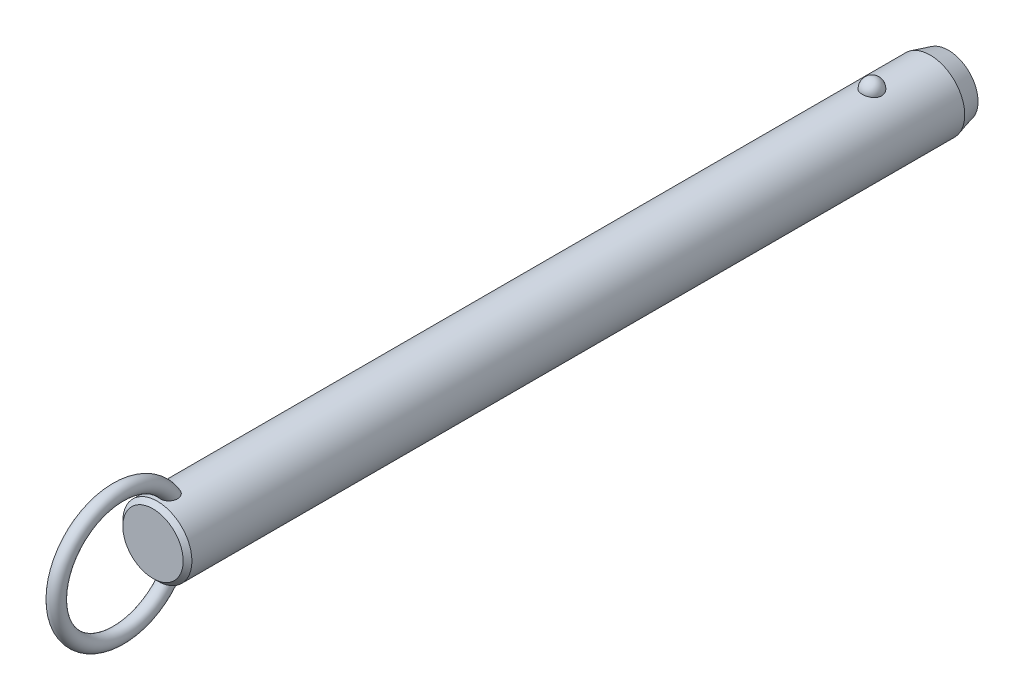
ISO-10303-21;
HEADER;
FILE_DESCRIPTION(('STEP AP214'),'2;1');
FILE_NAME('part.step','',(''),(''),'','','');
FILE_SCHEMA(('AUTOMOTIVE_DESIGN { 1 0 10303 214 1 1 1 1 }'));
ENDSEC;
DATA;
#1=APPLICATION_CONTEXT('core data for automotive mechanical design processes');
#2=APPLICATION_PROTOCOL_DEFINITION('international standard','automotive_design',2000,#1);
#3=PRODUCT_CONTEXT('',#1,'mechanical');
#4=PRODUCT('Part','Part','',(#3));
#5=PRODUCT_RELATED_PRODUCT_CATEGORY('part','',(#4));
#6=PRODUCT_DEFINITION_FORMATION('','',#4);
#7=PRODUCT_DEFINITION_CONTEXT('part definition',#1,'design');
#8=PRODUCT_DEFINITION('design','',#6,#7);
#9=PRODUCT_DEFINITION_SHAPE('','',#8);
#10=(LENGTH_UNIT() NAMED_UNIT(*) SI_UNIT(.MILLI.,.METRE.));
#11=(NAMED_UNIT(*) PLANE_ANGLE_UNIT() SI_UNIT($,.RADIAN.));
#12=(NAMED_UNIT(*) SI_UNIT($,.STERADIAN.) SOLID_ANGLE_UNIT());
#13=UNCERTAINTY_MEASURE_WITH_UNIT(LENGTH_MEASURE(1.E-05),#10,'distance_accuracy_value','');
#14=(GEOMETRIC_REPRESENTATION_CONTEXT(3) GLOBAL_UNCERTAINTY_ASSIGNED_CONTEXT((#13)) GLOBAL_UNIT_ASSIGNED_CONTEXT((#10,
#11,#12)) REPRESENTATION_CONTEXT('',''));
#15=CARTESIAN_POINT('',(0.,0.,0.));
#16=DIRECTION('',(0.,0.,1.));
#17=DIRECTION('',(1.,0.,0.));
#18=AXIS2_PLACEMENT_3D('',#15,#16,#17);
#19=CARTESIAN_POINT('',(0.,0.,185.4));
#20=DIRECTION('',(0.,0.,-1.));
#21=DIRECTION('',(-1.,0.,0.));
#22=AXIS2_PLACEMENT_3D('',#19,#20,#21);
#23=CYLINDRICAL_SURFACE('',#22,9.5);
#24=CARTESIAN_POINT('',(2.67259918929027,9.11631578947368,-2.70000000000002));
#25=CARTESIAN_POINT('',(2.6725968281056,9.11631786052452,-2.54909854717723));
#26=CARTESIAN_POINT('',(2.66030567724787,9.11994722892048,-2.39816735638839));
#27=CARTESIAN_POINT('',(2.6114347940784,9.13405924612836,-2.10058568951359));
#28=CARTESIAN_POINT('',(2.57484658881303,9.14454428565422,-1.95393672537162));
#29=CARTESIAN_POINT('',(2.47830875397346,9.17117631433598,-1.66916069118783));
#30=CARTESIAN_POINT('',(2.41836936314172,9.18732082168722,-1.53102991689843));
#31=CARTESIAN_POINT('',(2.27661331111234,9.22346780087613,-1.26705393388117));
#32=CARTESIAN_POINT('',(2.19479699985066,9.24347021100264,-1.14120852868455));
#33=CARTESIAN_POINT('',(2.01085282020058,9.28522401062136,-0.904632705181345));
#34=CARTESIAN_POINT('',(1.90862396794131,9.30698376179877,-0.79398224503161));
#35=CARTESIAN_POINT('',(1.6867437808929,9.34973971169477,-0.591607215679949));
#36=CARTESIAN_POINT('',(1.56709244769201,9.37073591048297,-0.499882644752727));
#37=CARTESIAN_POINT('',(1.31393976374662,9.40956370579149,-0.338167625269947));
#38=CARTESIAN_POINT('',(1.18048026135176,9.42740444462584,-0.268113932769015));
#39=CARTESIAN_POINT('',(0.903154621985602,9.45799906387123,-0.151390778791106));
#40=CARTESIAN_POINT('',(0.759289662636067,9.47075351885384,-0.104718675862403));
#41=CARTESIAN_POINT('',(0.46807402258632,9.48956256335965,-0.0367633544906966));
#42=CARTESIAN_POINT('',(0.320836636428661,9.49573643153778,-0.0150275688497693));
#43=CARTESIAN_POINT('',(0.0246714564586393,9.50112183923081,0.0039619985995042));
#44=CARTESIAN_POINT('',(-0.124256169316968,9.50033406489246,0.00121819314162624));
#45=CARTESIAN_POINT('',(-0.417264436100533,9.4919475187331,-0.0284441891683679));
#46=CARTESIAN_POINT('',(-0.561384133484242,9.48444885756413,-0.0550074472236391));
#47=CARTESIAN_POINT('',(-0.842986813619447,9.46357853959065,-0.131064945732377));
#48=CARTESIAN_POINT('',(-0.98046968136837,9.450206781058,-0.180559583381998));
#49=CARTESIAN_POINT('',(-1.24585005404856,9.41890822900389,-0.301476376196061));
#50=CARTESIAN_POINT('',(-1.37368611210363,9.40095498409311,-0.373026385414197));
#51=CARTESIAN_POINT('',(-1.61552738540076,9.36242964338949,-0.53602540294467));
#52=CARTESIAN_POINT('',(-1.72953116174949,9.34185727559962,-0.627476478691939));
#53=CARTESIAN_POINT('',(-1.9429225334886,9.29984568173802,-0.829844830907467));
#54=CARTESIAN_POINT('',(-2.04198021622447,9.27839736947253,-0.941108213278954));
#55=CARTESIAN_POINT('',(-2.2202646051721,9.23735994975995,-1.17883414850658));
#56=CARTESIAN_POINT('',(-2.29948985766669,9.21777097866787,-1.30529781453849));
#57=CARTESIAN_POINT('',(-2.43697287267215,9.18238994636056,-1.57158566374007));
#58=CARTESIAN_POINT('',(-2.49497068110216,9.16664569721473,-1.71155057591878));
#59=CARTESIAN_POINT('',(-2.5872073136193,9.14104303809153,-1.99961197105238));
#60=CARTESIAN_POINT('',(-2.62144683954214,9.13118445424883,-2.1477082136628));
#61=CARTESIAN_POINT('',(-2.66521466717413,9.11850622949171,-2.44715424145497));
#62=CARTESIAN_POINT('',(-2.67484831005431,9.11565658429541,-2.59848735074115));
#63=CARTESIAN_POINT('',(-2.66946735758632,9.11723375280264,-2.90067317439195));
#64=CARTESIAN_POINT('',(-2.65445345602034,9.12166036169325,-3.05152590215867));
#65=CARTESIAN_POINT('',(-2.60029711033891,9.13724422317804,-3.34766110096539));
#66=CARTESIAN_POINT('',(-2.56127978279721,9.14836656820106,-3.49296833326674));
#67=CARTESIAN_POINT('',(-2.46018844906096,9.17606676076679,-3.77477535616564));
#68=CARTESIAN_POINT('',(-2.39811349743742,9.19264483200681,-3.91127478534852));
#69=CARTESIAN_POINT('',(-2.25202303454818,9.22952198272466,-4.17244273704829));
#70=CARTESIAN_POINT('',(-2.16788714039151,9.24984129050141,-4.29704106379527));
#71=CARTESIAN_POINT('',(-1.9799408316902,9.29188255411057,-4.53013066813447));
#72=CARTESIAN_POINT('',(-1.87612963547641,9.31360456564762,-4.63862130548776));
#73=CARTESIAN_POINT('',(-1.65105429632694,9.35612959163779,-4.83690299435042));
#74=CARTESIAN_POINT('',(-1.52972405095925,9.37692871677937,-4.9266199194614));
#75=CARTESIAN_POINT('',(-1.27318250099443,9.41518970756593,-5.08429106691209));
#76=CARTESIAN_POINT('',(-1.13797219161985,9.432651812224,-5.15224684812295));
#77=CARTESIAN_POINT('',(-0.859280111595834,9.46208255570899,-5.26371827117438));
#78=CARTESIAN_POINT('',(-0.715925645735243,9.47411833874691,-5.30753421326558));
#79=CARTESIAN_POINT('',(-0.423550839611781,9.4916822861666,-5.37076321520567));
#80=CARTESIAN_POINT('',(-0.274531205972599,9.49721125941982,-5.39017930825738));
#81=CARTESIAN_POINT('',(0.0218446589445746,9.50110860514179,-5.40390587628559));
#82=CARTESIAN_POINT('',(0.169177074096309,9.49961381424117,-5.39869609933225));
#83=CARTESIAN_POINT('',(0.460808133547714,9.48993906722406,-5.36441955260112));
#84=CARTESIAN_POINT('',(0.605106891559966,9.48175936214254,-5.33535367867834));
#85=CARTESIAN_POINT('',(0.886027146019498,9.4596376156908,-5.25435587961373));
#86=CARTESIAN_POINT('',(1.02267710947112,9.44571881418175,-5.20251612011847));
#87=CARTESIAN_POINT('',(1.28523827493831,9.41358993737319,-5.07741549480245));
#88=CARTESIAN_POINT('',(1.41114877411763,9.39537958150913,-5.00415322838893));
#89=CARTESIAN_POINT('',(1.65085227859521,9.3562644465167,-4.83684599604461));
#90=CARTESIAN_POINT('',(1.76442346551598,9.33532178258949,-4.74249218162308));
#91=CARTESIAN_POINT('',(1.97425672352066,9.29321198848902,-4.53620389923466));
#92=CARTESIAN_POINT('',(2.07051582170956,9.27204482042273,-4.42426641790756));
#93=CARTESIAN_POINT('',(2.24490086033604,9.23139221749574,-4.18363183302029));
#94=CARTESIAN_POINT('',(2.32267019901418,9.21194380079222,-4.05466990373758));
#95=CARTESIAN_POINT('',(2.45584092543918,9.1773419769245,-3.78517836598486));
#96=CARTESIAN_POINT('',(2.5112497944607,9.16218713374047,-3.644652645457));
#97=CARTESIAN_POINT('',(2.59380876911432,9.13913522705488,-3.37104301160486));
#98=CARTESIAN_POINT('',(2.62330266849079,9.13064624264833,-3.23871053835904));
#99=CARTESIAN_POINT('',(2.66269870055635,9.11923566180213,-2.97092664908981));
#100=CARTESIAN_POINT('',(2.67260130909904,9.11631393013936,-2.83547530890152));
#101=CARTESIAN_POINT('',(2.67259918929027,9.11631578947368,-2.70000000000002));
#102=B_SPLINE_CURVE_WITH_KNOTS('',3,(#24,#25,#26,#27,#28,#29,#30,#31,#32,#33,#34,#35,#36,#37,
#38,#39,#40,#41,#42,#43,#44,#45,#46,#47,#48,#49,#50,#51,#52,#53,#54,#55,#56,#57,#58,#59,#60,#61,
#62,#63,#64,#65,#66,#67,#68,#69,#70,#71,#72,#73,#74,#75,#76,#77,#78,#79,#80,#81,#82,#83,#84,#85,
#86,#87,#88,#89,#90,#91,#92,#93,#94,#95,#96,#97,#98,#99,#100,#101),.UNSPECIFIED.,.T.,.F.,(4,2,2,
2,2,2,2,2,2,2,2,2,2,2,2,2,2,2,2,2,2,2,2,2,2,2,2,2,2,2,2,2,2,2,2,2,2,2,4),(0.,0.452217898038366,
0.904593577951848,1.35677112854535,1.80894144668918,2.26340676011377,2.71787203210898,
3.17099820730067,3.62407318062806,4.0687883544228,4.51345969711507,4.95160616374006,
5.38976021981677,5.83050358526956,6.27129275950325,6.72071308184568,7.17016633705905,
7.62495278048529,8.07972578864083,8.53254856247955,8.98535859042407,9.43582813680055,
9.88631615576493,10.3393155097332,10.7923328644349,11.2471065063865,11.7018475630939,
12.150795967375,12.599688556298,13.0398725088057,13.4800399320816,13.9184421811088,
14.3568730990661,14.802202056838,15.2476074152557,15.7010097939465,16.1542603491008,
16.5602594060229,16.9662486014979),.UNSPECIFIED.);
#103=CARTESIAN_POINT('',(2.67259918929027,9.11631578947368,-2.70000000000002));
#104=VERTEX_POINT('',#103);
#105=EDGE_CURVE('E41',#104,#104,#102,.T.);
#106=ORIENTED_EDGE('',*,*,#105,.T.);
#107=EDGE_LOOP('',(#106));
#108=FACE_BOUND('',#107,.T.);
#109=CARTESIAN_POINT('',(0.,0.,193.72));
#110=DIRECTION('',(0.,0.,1.));
#111=DIRECTION('',(1.,0.,0.));
#112=AXIS2_PLACEMENT_3D('',#109,#110,#111);
#113=CIRCLE('',#112,9.5);
#114=CARTESIAN_POINT('',(9.5,0.,193.72));
#115=VERTEX_POINT('',#114);
#116=EDGE_CURVE('E10',#115,#115,#113,.F.);
#117=ORIENTED_EDGE('',*,*,#116,.T.);
#118=EDGE_LOOP('',(#117));
#119=FACE_BOUND('',#118,.T.);
#120=CARTESIAN_POINT('',(-0.697062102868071,-9.47439269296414,188.067808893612));
#121=CARTESIAN_POINT('',(-0.799579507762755,-9.46685146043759,188.107482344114));
#122=CARTESIAN_POINT('',(-0.898575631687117,-9.45788043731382,188.1559309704));
#123=CARTESIAN_POINT('',(-1.08670047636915,-9.43811593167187,188.268868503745));
#124=CARTESIAN_POINT('',(-1.17583204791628,-9.42732297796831,188.333352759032));
#125=CARTESIAN_POINT('',(-1.34179806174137,-9.40513672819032,188.476209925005));
#126=CARTESIAN_POINT('',(-1.41865133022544,-9.39374438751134,188.554561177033));
#127=CARTESIAN_POINT('',(-1.55860047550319,-9.37154196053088,188.722752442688));
#128=CARTESIAN_POINT('',(-1.62169476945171,-9.3607319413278,188.81259377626));
#129=CARTESIAN_POINT('',(-1.73527695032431,-9.34035749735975,189.004500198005));
#130=CARTESIAN_POINT('',(-1.78522266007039,-9.33085270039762,189.106891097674));
#131=CARTESIAN_POINT('',(-1.86924997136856,-9.3143834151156,189.318148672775));
#132=CARTESIAN_POINT('',(-1.90332570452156,-9.30741986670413,189.427017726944));
#133=CARTESIAN_POINT('',(-1.95893603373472,-9.29588482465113,189.660473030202));
#134=CARTESIAN_POINT('',(-1.97872420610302,-9.29165182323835,189.785489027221));
#135=CARTESIAN_POINT('',(-2.00062129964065,-9.28695978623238,190.037080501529));
#136=CARTESIAN_POINT('',(-2.00272284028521,-9.28650232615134,190.163656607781));
#137=CARTESIAN_POINT('',(-1.98958876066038,-9.28932750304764,190.436815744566));
#138=CARTESIAN_POINT('',(-1.97143366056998,-9.2932400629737,190.583251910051));
#139=CARTESIAN_POINT('',(-1.91479925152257,-9.30507151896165,190.872062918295));
#140=CARTESIAN_POINT('',(-1.87629122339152,-9.31299607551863,191.014431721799));
#141=CARTESIAN_POINT('',(-1.77225683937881,-9.33340232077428,191.315172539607));
#142=CARTESIAN_POINT('',(-1.70334898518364,-9.34641636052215,191.472369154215));
#143=CARTESIAN_POINT('',(-1.58111062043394,-9.36759153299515,191.697517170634));
#144=CARTESIAN_POINT('',(-1.53721459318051,-9.37492619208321,191.770796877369));
#145=CARTESIAN_POINT('',(-1.4430263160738,-9.38988566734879,191.91307405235));
#146=CARTESIAN_POINT('',(-1.39273721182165,-9.39751033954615,191.982073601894));
#147=CARTESIAN_POINT('',(-1.26775962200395,-9.41530678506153,192.136983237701));
#148=CARTESIAN_POINT('',(-1.19052326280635,-9.42548108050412,192.220871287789));
#149=CARTESIAN_POINT('',(-1.02420241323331,-9.44499825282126,192.376008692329));
#150=CARTESIAN_POINT('',(-0.93513986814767,-9.45434261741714,192.447280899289));
#151=CARTESIAN_POINT('',(-0.766610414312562,-9.46930670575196,192.558695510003));
#152=CARTESIAN_POINT('',(-0.689439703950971,-9.47529223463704,192.602235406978));
#153=CARTESIAN_POINT('',(-0.528942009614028,-9.48560294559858,192.67631336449));
#154=CARTESIAN_POINT('',(-0.445620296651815,-9.48992953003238,192.706862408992));
#155=CARTESIAN_POINT('',(-0.273901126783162,-9.49644161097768,192.752579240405));
#156=CARTESIAN_POINT('',(-0.18546574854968,-9.49860811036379,192.76761059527));
#157=CARTESIAN_POINT('',(-0.00734541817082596,-9.5004135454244,192.780149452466));
#158=CARTESIAN_POINT('',(0.0823387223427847,-9.50005405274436,192.777667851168));
#159=CARTESIAN_POINT('',(0.247679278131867,-9.49708301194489,192.756995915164));
#160=CARTESIAN_POINT('',(0.323620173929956,-9.49477609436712,192.740930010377));
#161=CARTESIAN_POINT('',(0.471981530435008,-9.48855917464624,192.697172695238));
#162=CARTESIAN_POINT('',(0.544400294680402,-9.48464840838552,192.669475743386));
#163=CARTESIAN_POINT('',(0.708947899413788,-9.47398336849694,192.59280266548));
#164=CARTESIAN_POINT('',(0.799149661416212,-9.46671310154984,192.539774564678));
#165=CARTESIAN_POINT('',(0.969783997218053,-9.45076225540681,192.419973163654));
#166=CARTESIAN_POINT('',(1.050194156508,-9.44207854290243,192.353169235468));
#167=CARTESIAN_POINT('',(1.23092343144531,-9.42051459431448,192.180759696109));
#168=CARTESIAN_POINT('',(1.32652499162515,-9.40733378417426,192.07026193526));
#169=CARTESIAN_POINT('',(1.49893121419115,-9.38140745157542,191.835561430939));
#170=CARTESIAN_POINT('',(1.5757161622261,-9.36866239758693,191.711344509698));
#171=CARTESIAN_POINT('',(1.71285426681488,-9.34457644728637,191.449389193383));
#172=CARTESIAN_POINT('',(1.77266365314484,-9.33328726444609,191.31136233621));
#173=CARTESIAN_POINT('',(1.87239208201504,-9.31379209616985,191.028051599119));
#174=CARTESIAN_POINT('',(1.91230158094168,-9.3055875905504,190.882764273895));
#175=CARTESIAN_POINT('',(1.97604189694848,-9.29228394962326,190.562028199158));
#176=CARTESIAN_POINT('',(1.9958743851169,-9.28797202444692,190.385724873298));
#177=CARTESIAN_POINT('',(2.0029570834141,-9.28645519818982,190.032414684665));
#178=CARTESIAN_POINT('',(1.99025930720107,-9.28923895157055,189.855409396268));
#179=CARTESIAN_POINT('',(1.93735479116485,-9.30038134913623,189.556338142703));
#180=CARTESIAN_POINT('',(1.90576827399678,-9.30697680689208,189.432667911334));
#181=CARTESIAN_POINT('',(1.8228748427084,-9.32356855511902,189.192329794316));
#182=CARTESIAN_POINT('',(1.77158213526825,-9.33356239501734,189.075656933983));
#183=CARTESIAN_POINT('',(1.64885744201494,-9.35602275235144,188.852706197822));
#184=CARTESIAN_POINT('',(1.57730995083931,-9.36850332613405,188.746492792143));
#185=CARTESIAN_POINT('',(1.41543264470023,-9.39431873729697,188.549553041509));
#186=CARTESIAN_POINT('',(1.32510883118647,-9.40765330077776,188.458821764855));
#187=CARTESIAN_POINT('',(1.13846223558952,-9.43195720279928,188.305033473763));
#188=CARTESIAN_POINT('',(1.04369890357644,-9.44302894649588,188.240094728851));
#189=CARTESIAN_POINT('',(0.843965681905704,-9.46296805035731,188.128038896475));
#190=CARTESIAN_POINT('',(0.739000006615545,-9.47183631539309,188.080914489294));
#191=CARTESIAN_POINT('',(0.528175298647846,-9.48586140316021,188.008117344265));
#192=CARTESIAN_POINT('',(0.422686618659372,-9.49119633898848,187.98140249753));
#193=CARTESIAN_POINT('',(0.208590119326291,-9.49831365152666,187.946013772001));
#194=CARTESIAN_POINT('',(0.0999817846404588,-9.500095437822,187.937342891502));
#195=CARTESIAN_POINT('',(-0.126104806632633,-9.49988861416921,187.938350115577));
#196=CARTESIAN_POINT('',(-0.243578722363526,-9.49757821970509,187.949594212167));
#197=CARTESIAN_POINT('',(-0.474390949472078,-9.48885165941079,187.993167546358));
#198=CARTESIAN_POINT('',(-0.587729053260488,-9.48243528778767,188.025497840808));
#199=CARTESIAN_POINT('',(-0.697062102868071,-9.47439269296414,188.067808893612));
#200=B_SPLINE_CURVE_WITH_KNOTS('',3,(#120,#121,#122,#123,#124,#125,#126,#127,#128,#129,#130,
#131,#132,#133,#134,#135,#136,#137,#138,#139,#140,#141,#142,#143,#144,#145,#146,#147,#148,#149,
#150,#151,#152,#153,#154,#155,#156,#157,#158,#159,#160,#161,#162,#163,#164,#165,#166,#167,#168,
#169,#170,#171,#172,#173,#174,#175,#176,#177,#178,#179,#180,#181,#182,#183,#184,#185,#186,#187,
#188,#189,#190,#191,#192,#193,#194,#195,#196,#197,#198,#199),.UNSPECIFIED.,.T.,.F.,(4,2,2,2,2,2,
2,2,2,2,2,2,2,2,2,2,2,2,2,2,2,2,2,2,2,2,2,2,2,2,2,2,2,2,2,2,2,2,2,4),(0.,0.330119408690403,
0.660143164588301,0.989655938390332,1.31920659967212,1.66074728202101,2.00241415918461,
2.38088696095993,2.75951768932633,3.20065679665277,3.64242004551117,4.15620996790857,
4.4131416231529,4.66994734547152,5.01228664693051,5.35399933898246,5.61943037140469,
5.88463652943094,6.15215502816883,6.4195070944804,6.65144391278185,6.88349136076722,
7.19641200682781,7.51003602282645,7.94779711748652,8.3860149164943,8.83699707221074,
9.28819530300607,9.81778662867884,10.34653170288,10.7284172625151,11.1100280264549,
11.4938603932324,11.8775702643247,12.2220189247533,12.5663259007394,12.8915939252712,
13.2169159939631,13.5689650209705,13.9210316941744),.UNSPECIFIED.);
#201=CARTESIAN_POINT('',(-0.697062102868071,-9.47439269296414,188.067808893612));
#202=VERTEX_POINT('',#201);
#203=EDGE_CURVE('E59',#202,#202,#200,.T.);
#204=ORIENTED_EDGE('',*,*,#203,.T.);
#205=EDGE_LOOP('',(#204));
#206=FACE_BOUND('',#205,.T.);
#207=CARTESIAN_POINT('',(-0.697062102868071,9.47439269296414,188.067808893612));
#208=CARTESIAN_POINT('',(-0.597792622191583,9.48169483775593,188.02939564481));
#209=CARTESIAN_POINT('',(-0.495106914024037,9.48766580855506,187.999168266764));
#210=CARTESIAN_POINT('',(-0.285876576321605,9.49627648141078,187.956032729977));
#211=CARTESIAN_POINT('',(-0.179324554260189,9.49890941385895,187.943159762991));
#212=CARTESIAN_POINT('',(0.0344157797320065,9.50053798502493,187.935166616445));
#213=CARTESIAN_POINT('',(0.141603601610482,9.49953613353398,187.940034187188));
#214=CARTESIAN_POINT('',(0.35356357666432,9.49401038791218,187.967365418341));
#215=CARTESIAN_POINT('',(0.458336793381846,9.48948807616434,187.98982117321));
#216=CARTESIAN_POINT('',(0.662493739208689,9.4774236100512,188.051671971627));
#217=CARTESIAN_POINT('',(0.761881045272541,9.46988348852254,188.091055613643));
#218=CARTESIAN_POINT('',(0.95260839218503,9.45260382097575,188.185634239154));
#219=CARTESIAN_POINT('',(1.04394806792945,9.44286417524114,188.240829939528));
#220=CARTESIAN_POINT('',(1.21712767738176,9.42211760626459,188.366066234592));
#221=CARTESIAN_POINT('',(1.29885671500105,9.41109835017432,188.436257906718));
#222=CARTESIAN_POINT('',(1.44978975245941,9.38903310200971,188.588980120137));
#223=CARTESIAN_POINT('',(1.51899278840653,9.37798710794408,188.671511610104));
#224=CARTESIAN_POINT('',(1.64602857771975,9.35654375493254,188.849776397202));
#225=CARTESIAN_POINT('',(1.70333052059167,9.34618688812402,188.945891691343));
#226=CARTESIAN_POINT('',(1.80259341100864,9.32755128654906,189.145897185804));
#227=CARTESIAN_POINT('',(1.84454942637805,9.31927322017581,189.249789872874));
#228=CARTESIAN_POINT('',(1.91637039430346,9.30478365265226,189.472213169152));
#229=CARTESIAN_POINT('',(1.944805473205,9.29882552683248,189.591219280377));
#230=CARTESIAN_POINT('',(1.98449865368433,9.29043398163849,189.832143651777));
#231=CARTESIAN_POINT('',(1.99574908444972,9.28800213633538,189.954063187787));
#232=CARTESIAN_POINT('',(2.00275141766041,9.28649645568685,190.216932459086));
#233=CARTESIAN_POINT('',(1.99588238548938,9.28799035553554,190.357952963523));
#234=CARTESIAN_POINT('',(1.96270559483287,9.29505517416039,190.637621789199));
#235=CARTESIAN_POINT('',(1.93637872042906,9.30063010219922,190.776267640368));
#236=CARTESIAN_POINT('',(1.85949176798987,9.31633564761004,191.072561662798));
#237=CARTESIAN_POINT('',(1.80549792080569,9.3270926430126,191.229290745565));
#238=CARTESIAN_POINT('',(1.67376869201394,9.3516306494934,191.532284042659));
#239=CARTESIAN_POINT('',(1.59603181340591,9.36541185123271,191.678547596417));
#240=CARTESIAN_POINT('',(1.4360277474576,9.39110706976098,191.925813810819));
#241=CARTESIAN_POINT('',(1.35831795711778,9.40278656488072,192.029791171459));
#242=CARTESIAN_POINT('',(1.18774483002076,9.42585025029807,192.224534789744));
#243=CARTESIAN_POINT('',(1.09490932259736,9.43723493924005,192.315324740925));
#244=CARTESIAN_POINT('',(0.92111037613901,9.45552616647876,192.45620334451));
#245=CARTESIAN_POINT('',(0.84373824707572,9.46281058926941,192.510656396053));
#246=CARTESIAN_POINT('',(0.681245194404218,9.47589120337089,192.606711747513));
#247=CARTESIAN_POINT('',(0.596135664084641,9.48168953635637,192.648332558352));
#248=CARTESIAN_POINT('',(0.433779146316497,9.49038144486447,192.710089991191));
#249=CARTESIAN_POINT('',(0.357459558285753,9.49359170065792,192.73260136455));
#250=CARTESIAN_POINT('',(0.202074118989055,9.49816761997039,192.764574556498));
#251=CARTESIAN_POINT('',(0.123010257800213,9.49953459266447,192.774045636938));
#252=CARTESIAN_POINT('',(-0.0357372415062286,9.50026497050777,192.779114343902));
#253=CARTESIAN_POINT('',(-0.115421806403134,9.49962433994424,192.774684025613));
#254=CARTESIAN_POINT('',(-0.272823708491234,9.49640854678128,192.752296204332));
#255=CARTESIAN_POINT('',(-0.350540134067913,9.4938325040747,192.734332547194));
#256=CARTESIAN_POINT('',(-0.500580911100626,9.48709462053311,192.686802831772));
#257=CARTESIAN_POINT('',(-0.572979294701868,9.48296359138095,192.657461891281));
#258=CARTESIAN_POINT('',(-0.712864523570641,9.47347609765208,192.589008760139));
#259=CARTESIAN_POINT('',(-0.780349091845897,9.46811906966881,192.549892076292));
#260=CARTESIAN_POINT('',(-0.946309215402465,9.45329720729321,192.439432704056));
#261=CARTESIAN_POINT('',(-1.04090230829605,9.44321512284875,192.362329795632));
#262=CARTESIAN_POINT('',(-1.21661929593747,9.42219227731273,192.19409718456));
#263=CARTESIAN_POINT('',(-1.29770519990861,9.41124921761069,192.102929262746));
#264=CARTESIAN_POINT('',(-1.47319646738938,9.38563439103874,191.876162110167));
#265=CARTESIAN_POINT('',(-1.56208878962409,9.37102009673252,191.736289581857));
#266=CARTESIAN_POINT('',(-1.71623987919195,9.34401559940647,191.443950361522));
#267=CARTESIAN_POINT('',(-1.78147866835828,9.33162728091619,191.291473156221));
#268=CARTESIAN_POINT('',(-1.88853837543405,9.31055541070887,190.975647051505));
#269=CARTESIAN_POINT('',(-1.92998995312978,9.30193076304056,190.812168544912));
#270=CARTESIAN_POINT('',(-1.98590726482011,9.29015757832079,190.480526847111));
#271=CARTESIAN_POINT('',(-2.0004070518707,9.2870021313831,190.312369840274));
#272=CARTESIAN_POINT('',(-1.99964701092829,9.28716218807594,190.005080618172));
#273=CARTESIAN_POINT('',(-1.98908145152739,9.28945704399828,189.865936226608));
#274=CARTESIAN_POINT('',(-1.94566294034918,9.29865169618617,189.591153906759));
#275=CARTESIAN_POINT('',(-1.9128206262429,9.30554929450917,189.455514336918));
#276=CARTESIAN_POINT('',(-1.84582133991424,9.31898248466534,189.257802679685));
#277=CARTESIAN_POINT('',(-1.82038084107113,9.32400364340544,189.192583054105));
#278=CARTESIAN_POINT('',(-1.76350511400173,9.33492884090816,189.064903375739));
#279=CARTESIAN_POINT('',(-1.73207305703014,9.34083241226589,189.002441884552));
#280=CARTESIAN_POINT('',(-1.66324243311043,9.35333332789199,188.88094078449));
#281=CARTESIAN_POINT('',(-1.62584239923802,9.35993084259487,188.821902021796));
#282=CARTESIAN_POINT('',(-1.54527678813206,9.37356864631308,188.707987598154));
#283=CARTESIAN_POINT('',(-1.50211241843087,9.38060884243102,188.653111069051));
#284=CARTESIAN_POINT('',(-1.3768114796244,9.40004442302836,188.509961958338));
#285=CARTESIAN_POINT('',(-1.28916358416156,9.41261047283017,188.426429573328));
#286=CARTESIAN_POINT('',(-1.09996826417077,9.43658180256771,188.277236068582));
#287=CARTESIAN_POINT('',(-0.998461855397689,9.44799034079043,188.211523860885));
#288=CARTESIAN_POINT('',(-0.860188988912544,9.46103017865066,188.1394367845));
#289=CARTESIAN_POINT('',(-0.828141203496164,9.46389141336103,188.123851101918));
#290=CARTESIAN_POINT('',(-0.763210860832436,9.46934915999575,188.094473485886));
#291=CARTESIAN_POINT('',(-0.730328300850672,9.47194567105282,188.080681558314));
#292=CARTESIAN_POINT('',(-0.697062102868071,9.47439269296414,188.067808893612));
#293=B_SPLINE_CURVE_WITH_KNOTS('',3,(#207,#208,#209,#210,#211,#212,#213,#214,#215,#216,#217,
#218,#219,#220,#221,#222,#223,#224,#225,#226,#227,#228,#229,#230,#231,#232,#233,#234,#235,#236,
#237,#238,#239,#240,#241,#242,#243,#244,#245,#246,#247,#248,#249,#250,#251,#252,#253,#254,#255,
#256,#257,#258,#259,#260,#261,#262,#263,#264,#265,#266,#267,#268,#269,#270,#271,#272,#273,#274,
#275,#276,#277,#278,#279,#280,#281,#282,#283,#284,#285,#286,#287,#288,#289,#290,#291,#292),
.UNSPECIFIED.,.T.,.F.,(4,2,2,2,2,2,2,2,2,2,2,2,2,2,2,2,2,2,2,2,2,2,2,2,2,2,2,2,2,2,2,2,2,2,2,2,
2,2,2,2,2,2,4),(0.,0.319942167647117,0.640532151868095,0.96090081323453,1.2811255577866,
1.60113495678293,1.92115886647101,2.24457323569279,2.56801248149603,2.90371927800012,
3.23953387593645,3.60560313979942,3.97183576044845,4.39383693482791,4.8162532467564,
5.31257045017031,5.80891895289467,6.19868344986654,6.58773876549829,6.87145417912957,
7.15475838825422,7.39263751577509,7.63034760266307,7.86853584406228,8.10683246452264,
8.3406366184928,8.57454843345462,8.93983939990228,9.30614105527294,9.80266668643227,
10.2996107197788,10.8040753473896,11.3079021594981,11.7249776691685,12.1418541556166,
12.3521485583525,12.5623319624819,12.7725671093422,12.9827582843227,13.345827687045,
13.7078449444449,13.8150604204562,13.9222762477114),.UNSPECIFIED.);
#294=CARTESIAN_POINT('',(-0.697062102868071,9.47439269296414,188.067808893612));
#295=VERTEX_POINT('',#294);
#296=EDGE_CURVE('E67',#295,#295,#293,.T.);
#297=ORIENTED_EDGE('',*,*,#296,.T.);
#298=EDGE_LOOP('',(#297));
#299=FACE_BOUND('',#298,.T.);
#300=CARTESIAN_POINT('',(0.,0.,-18.6999999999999));
#301=DIRECTION('',(0.,0.,-1.));
#302=DIRECTION('',(-1.,0.,0.));
#303=AXIS2_PLACEMENT_3D('',#300,#301,#302);
#304=CIRCLE('',#303,9.5);
#305=CARTESIAN_POINT('',(-9.5,0.,-18.6999999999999));
#306=VERTEX_POINT('',#305);
#307=EDGE_CURVE('E56',#306,#306,#304,.F.);
#308=ORIENTED_EDGE('',*,*,#307,.T.);
#309=EDGE_LOOP('',(#308));
#310=FACE_BOUND('',#309,.T.);
#311=ADVANCED_FACE('F37',(#108,#119,#206,#299,#310),#23,.T.);
#312=CARTESIAN_POINT('',(0.,0.,-23.7));
#313=DIRECTION('',(0.,0.,-1.));
#314=DIRECTION('',(-1.,0.,0.));
#315=AXIS2_PLACEMENT_3D('',#312,#313,#314);
#316=PLANE('',#315);
#317=CARTESIAN_POINT('',(0.,0.,-23.7));
#318=DIRECTION('',(0.,0.,-1.));
#319=DIRECTION('',(-1.,0.,0.));
#320=AXIS2_PLACEMENT_3D('',#317,#318,#319);
#321=CIRCLE('',#320,8.16025403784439);
#322=CARTESIAN_POINT('',(-8.16025403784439,0.,-23.7));
#323=VERTEX_POINT('',#322);
#324=EDGE_CURVE('E66',#323,#323,#321,.T.);
#325=ORIENTED_EDGE('',*,*,#324,.T.);
#326=EDGE_LOOP('',(#325));
#327=FACE_BOUND('',#326,.T.);
#328=ADVANCED_FACE('F85',(#327),#316,.T.);
#329=CARTESIAN_POINT('',(0.,0.,-23.7));
#330=DIRECTION('',(0.,0.,1.));
#331=DIRECTION('',(1.,0.,0.));
#332=AXIS2_PLACEMENT_3D('',#329,#330,#331);
#333=CONICAL_SURFACE('',#332,8.16025403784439,0.261799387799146);
#334=ORIENTED_EDGE('',*,*,#307,.F.);
#335=EDGE_LOOP('',(#334));
#336=FACE_BOUND('',#335,.T.);
#337=ORIENTED_EDGE('',*,*,#324,.F.);
#338=EDGE_LOOP('',(#337));
#339=FACE_BOUND('',#338,.T.);
#340=ADVANCED_FACE('F83',(#336,#339),#333,.T.);
#341=CARTESIAN_POINT('',(0.,0.,194.92));
#342=DIRECTION('',(0.,0.,1.));
#343=DIRECTION('',(1.,0.,0.));
#344=AXIS2_PLACEMENT_3D('',#341,#342,#343);
#345=PLANE('',#344);
#346=CARTESIAN_POINT('',(0.,0.,194.92));
#347=DIRECTION('',(0.,0.,1.));
#348=DIRECTION('',(1.,0.,0.));
#349=AXIS2_PLACEMENT_3D('',#346,#347,#348);
#350=CIRCLE('',#349,8.30000000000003);
#351=CARTESIAN_POINT('',(8.30000000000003,0.,194.92));
#352=VERTEX_POINT('',#351);
#353=EDGE_CURVE('E50',#352,#352,#350,.T.);
#354=ORIENTED_EDGE('',*,*,#353,.T.);
#355=EDGE_LOOP('',(#354));
#356=FACE_BOUND('',#355,.T.);
#357=ADVANCED_FACE('F77',(#356),#345,.T.);
#358=CARTESIAN_POINT('',(0.,0.,204.45));
#359=DIRECTION('',(1.,0.,0.));
#360=DIRECTION('',(0.,0.,-1.));
#361=AXIS2_PLACEMENT_3D('',#358,#359,#360);
#362=TOROIDAL_SURFACE('',#361,17.05,2.);
#363=ORIENTED_EDGE('',*,*,#296,.F.);
#364=EDGE_LOOP('',(#363));
#365=FACE_BOUND('',#364,.T.);
#366=ORIENTED_EDGE('',*,*,#203,.F.);
#367=EDGE_LOOP('',(#366));
#368=FACE_BOUND('',#367,.T.);
#369=ADVANCED_FACE('F73',(#365,#368),#362,.T.);
#370=CARTESIAN_POINT('',(0.,0.,194.92));
#371=DIRECTION('',(0.,0.,-1.));
#372=DIRECTION('',(-1.,0.,0.));
#373=AXIS2_PLACEMENT_3D('',#370,#371,#372);
#374=CONICAL_SURFACE('',#373,8.30000000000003,0.785398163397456);
#375=ORIENTED_EDGE('',*,*,#116,.F.);
#376=EDGE_LOOP('',(#375));
#377=FACE_BOUND('',#376,.T.);
#378=ORIENTED_EDGE('',*,*,#353,.F.);
#379=EDGE_LOOP('',(#378));
#380=FACE_BOUND('',#379,.T.);
#381=ADVANCED_FACE('F39',(#377,#380),#374,.T.);
#382=CARTESIAN_POINT('',(0.,9.5,-2.70000000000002));
#383=DIRECTION('',(0.,1.,0.));
#384=DIRECTION('',(0.,0.,1.));
#385=AXIS2_PLACEMENT_3D('',#382,#383,#384);
#386=SPHERICAL_SURFACE('',#385,2.7);
#387=ORIENTED_EDGE('',*,*,#105,.F.);
#388=EDGE_LOOP('',(#387));
#389=FACE_BOUND('',#388,.T.);
#390=ADVANCED_FACE('F79',(#389),#386,.T.);
#391=CLOSED_SHELL('',(#311,#328,#340,#357,#369,#381,#390));
#392=MANIFOLD_SOLID_BREP('B2',#391);
#393=ADVANCED_BREP_SHAPE_REPRESENTATION('',(#18,#392),#14);
#394=SHAPE_DEFINITION_REPRESENTATION(#9,#393);
ENDSEC;
END-ISO-10303-21;
